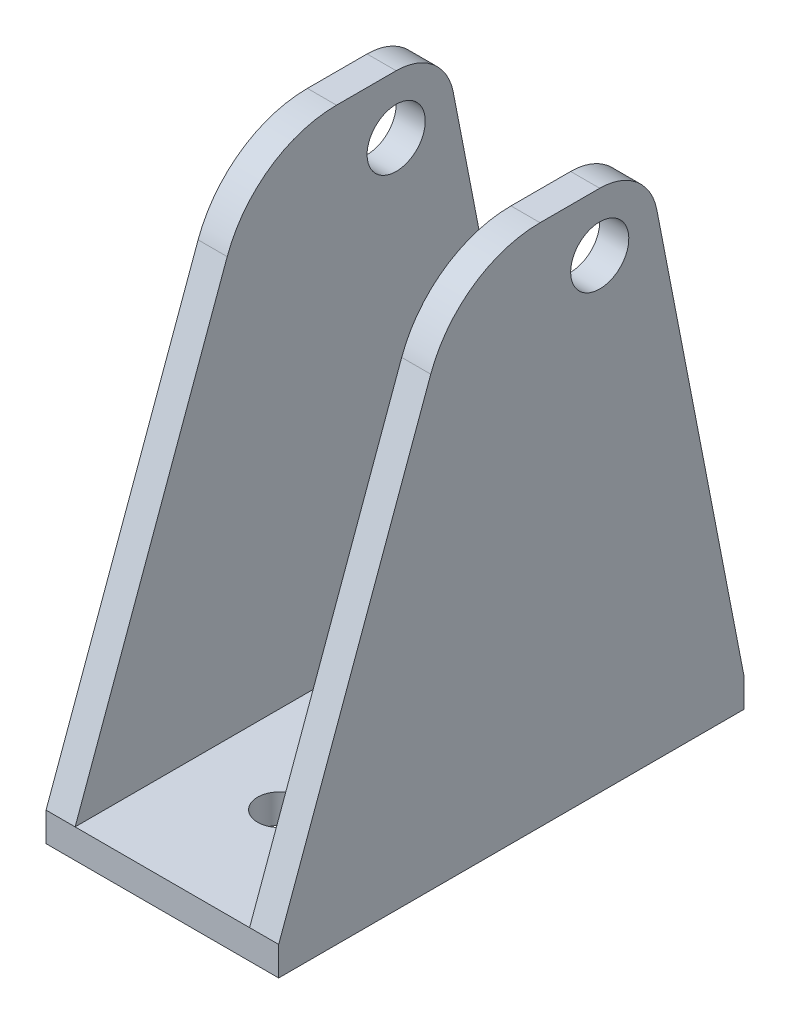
ISO-10303-21;
HEADER;
FILE_DESCRIPTION(('STEP AP214'),'2;1');
FILE_NAME('part.step','',(''),(''),'','','');
FILE_SCHEMA(('AUTOMOTIVE_DESIGN { 1 0 10303 214 1 1 1 1 }'));
ENDSEC;
DATA;
#1=APPLICATION_CONTEXT('core data for automotive mechanical design processes');
#2=APPLICATION_PROTOCOL_DEFINITION('international standard','automotive_design',2000,#1);
#3=PRODUCT_CONTEXT('',#1,'mechanical');
#4=PRODUCT('Part','Part','',(#3));
#5=PRODUCT_RELATED_PRODUCT_CATEGORY('part','',(#4));
#6=PRODUCT_DEFINITION_FORMATION('','',#4);
#7=PRODUCT_DEFINITION_CONTEXT('part definition',#1,'design');
#8=PRODUCT_DEFINITION('design','',#6,#7);
#9=PRODUCT_DEFINITION_SHAPE('','',#8);
#10=(LENGTH_UNIT() NAMED_UNIT(*) SI_UNIT(.MILLI.,.METRE.));
#11=(NAMED_UNIT(*) PLANE_ANGLE_UNIT() SI_UNIT($,.RADIAN.));
#12=(NAMED_UNIT(*) SI_UNIT($,.STERADIAN.) SOLID_ANGLE_UNIT());
#13=UNCERTAINTY_MEASURE_WITH_UNIT(LENGTH_MEASURE(1.E-05),#10,'distance_accuracy_value','');
#14=(GEOMETRIC_REPRESENTATION_CONTEXT(3) GLOBAL_UNCERTAINTY_ASSIGNED_CONTEXT((#13)) GLOBAL_UNIT_ASSIGNED_CONTEXT((#10,
#11,#12)) REPRESENTATION_CONTEXT('',''));
#15=CARTESIAN_POINT('',(0.,0.,0.));
#16=DIRECTION('',(0.,0.,1.));
#17=DIRECTION('',(1.,0.,0.));
#18=AXIS2_PLACEMENT_3D('',#15,#16,#17);
#19=CARTESIAN_POINT('',(25.401,-6.35,6.35));
#20=DIRECTION('',(-1.,0.,0.));
#21=DIRECTION('',(0.,0.,1.));
#22=AXIS2_PLACEMENT_3D('',#19,#20,#21);
#23=CYLINDRICAL_SURFACE('',#22,6.35);
#24=DIRECTION('',(1.,0.,0.));
#25=VECTOR('',#24,1.);
#26=CARTESIAN_POINT('',(-42.1329313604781,0.,6.35000000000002));
#27=LINE('',#26,#25);
#28=CARTESIAN_POINT('',(22.225,0.,6.35000000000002));
#29=VERTEX_POINT('',#28);
#30=CARTESIAN_POINT('',(25.3999999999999,0.,6.35));
#31=VERTEX_POINT('',#30);
#32=EDGE_CURVE('E264',#29,#31,#27,.T.);
#33=ORIENTED_EDGE('',*,*,#32,.T.);
#34=CARTESIAN_POINT('',(25.3999999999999,-6.35,6.35));
#35=DIRECTION('',(-1.,0.,0.));
#36=DIRECTION('',(0.,-1.,0.));
#37=AXIS2_PLACEMENT_3D('',#34,#35,#36);
#38=CIRCLE('',#37,6.35);
#39=CARTESIAN_POINT('',(25.4,-5.1356837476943,0.117188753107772));
#40=VERTEX_POINT('',#39);
#41=EDGE_CURVE('E184',#31,#40,#38,.T.);
#42=ORIENTED_EDGE('',*,*,#41,.T.);
#43=DIRECTION('',(-1.,0.,0.));
#44=VECTOR('',#43,1.);
#45=CARTESIAN_POINT('',(25.401,-5.1356837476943,0.117188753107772));
#46=LINE('',#45,#44);
#47=CARTESIAN_POINT('',(22.225,-5.1356837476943,0.117188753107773));
#48=VERTEX_POINT('',#47);
#49=EDGE_CURVE('E161',#40,#48,#46,.T.);
#50=ORIENTED_EDGE('',*,*,#49,.T.);
#51=CARTESIAN_POINT('',(22.225,-6.35,6.35));
#52=DIRECTION('',(1.,0.,0.));
#53=DIRECTION('',(0.,0.,1.));
#54=AXIS2_PLACEMENT_3D('',#51,#52,#53);
#55=CIRCLE('',#54,6.35);
#56=EDGE_CURVE('E172',#48,#29,#55,.T.);
#57=ORIENTED_EDGE('',*,*,#56,.T.);
#58=EDGE_LOOP('',(#33,#42,#50,#57));
#59=FACE_BOUND('',#58,.T.);
#60=ADVANCED_FACE('F51',(#59),#23,.T.);
#61=CARTESIAN_POINT('',(25.4,-53.975,38.1));
#62=DIRECTION('',(-1.,0.,0.));
#63=DIRECTION('',(0.,-1.,0.));
#64=AXIS2_PLACEMENT_3D('',#61,#62,#63);
#65=PLANE('',#64);
#66=CARTESIAN_POINT('',(25.3999999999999,-6.35,6.35));
#67=DIRECTION('',(-1.,0.,0.));
#68=DIRECTION('',(0.,-1.,0.));
#69=AXIS2_PLACEMENT_3D('',#66,#67,#68);
#70=CIRCLE('',#69,3.175);
#71=CARTESIAN_POINT('',(25.4,-9.525,6.35));
#72=VERTEX_POINT('',#71);
#73=EDGE_CURVE('E274',#72,#72,#70,.F.);
#74=ORIENTED_EDGE('',*,*,#73,.F.);
#75=EDGE_LOOP('',(#74));
#76=FACE_BOUND('',#75,.T.);
#77=DIRECTION('',(0.,0.,1.));
#78=VECTOR('',#77,1.);
#79=CARTESIAN_POINT('',(25.3999999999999,0.,6.35000000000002));
#80=LINE('',#79,#78);
#81=CARTESIAN_POINT('',(25.3999999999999,0.,12.8640708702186));
#82=VERTEX_POINT('',#81);
#83=EDGE_CURVE('E260',#31,#82,#80,.T.);
#84=ORIENTED_EDGE('',*,*,#83,.T.);
#85=CARTESIAN_POINT('',(25.4,-12.7,12.8640708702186));
#86=DIRECTION('',(-1.,0.,0.));
#87=DIRECTION('',(0.,-1.,0.));
#88=AXIS2_PLACEMENT_3D('',#85,#86,#87);
#89=CIRCLE('',#88,12.7);
#90=CARTESIAN_POINT('',(25.4,-8.35634417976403,24.7981671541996));
#91=VERTEX_POINT('',#90);
#92=EDGE_CURVE('E227',#82,#91,#89,.F.);
#93=ORIENTED_EDGE('',*,*,#92,.T.);
#94=DIRECTION('',(0.,-0.93969262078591,0.342020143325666));
#95=VECTOR('',#94,1.);
#96=CARTESIAN_POINT('',(25.4,-53.975,41.402));
#97=LINE('',#96,#95);
#98=CARTESIAN_POINT('',(25.4,-53.975,41.402));
#99=VERTEX_POINT('',#98);
#100=EDGE_CURVE('E267',#91,#99,#97,.T.);
#101=ORIENTED_EDGE('',*,*,#100,.T.);
#102=DIRECTION('',(0.,1.,0.));
#103=VECTOR('',#102,1.);
#104=CARTESIAN_POINT('',(25.4,-57.15,41.402));
#105=LINE('',#104,#103);
#106=CARTESIAN_POINT('',(25.4,-57.15,41.402));
#107=VERTEX_POINT('',#106);
#108=EDGE_CURVE('E302',#107,#99,#105,.T.);
#109=ORIENTED_EDGE('',*,*,#108,.F.);
#110=DIRECTION('',(0.,0.,-1.));
#111=VECTOR('',#110,1.);
#112=CARTESIAN_POINT('',(25.4,-57.15,38.1));
#113=LINE('',#112,#111);
#114=CARTESIAN_POINT('',(25.4,-57.15,-9.398));
#115=VERTEX_POINT('',#114);
#116=EDGE_CURVE('E219',#107,#115,#113,.T.);
#117=ORIENTED_EDGE('',*,*,#116,.T.);
#118=DIRECTION('',(0.,-1.,0.));
#119=VECTOR('',#118,1.);
#120=CARTESIAN_POINT('',(25.4,-53.975,-9.398));
#121=LINE('',#120,#119);
#122=CARTESIAN_POINT('',(25.4,-53.975,-9.398));
#123=VERTEX_POINT('',#122);
#124=EDGE_CURVE('E191',#123,#115,#121,.T.);
#125=ORIENTED_EDGE('',*,*,#124,.F.);
#126=DIRECTION('',(0.,-0.981545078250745,-0.191230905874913));
#127=VECTOR('',#126,1.);
#128=CARTESIAN_POINT('',(25.4,-53.975,-9.398));
#129=LINE('',#128,#127);
#130=EDGE_CURVE('E157',#40,#123,#129,.T.);
#131=ORIENTED_EDGE('',*,*,#130,.F.);
#132=ORIENTED_EDGE('',*,*,#41,.F.);
#133=EDGE_LOOP('',(#84,#93,#101,#109,#117,#125,#131,#132));
#134=FACE_BOUND('',#133,.T.);
#135=ADVANCED_FACE('F339',(#76,#134),#65,.F.);
#136=CARTESIAN_POINT('',(22.225,0.,-9.398));
#137=DIRECTION('',(1.,0.,0.));
#138=DIRECTION('',(0.,0.,-1.));
#139=AXIS2_PLACEMENT_3D('',#136,#137,#138);
#140=PLANE('',#139);
#141=DIRECTION('',(0.,0.93969262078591,-0.342020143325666));
#142=VECTOR('',#141,1.);
#143=CARTESIAN_POINT('',(22.225,-53.9750000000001,41.402));
#144=LINE('',#143,#142);
#145=CARTESIAN_POINT('',(22.225,-53.975,41.402));
#146=VERTEX_POINT('',#145);
#147=CARTESIAN_POINT('',(22.225,-8.35634417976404,24.7981671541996));
#148=VERTEX_POINT('',#147);
#149=EDGE_CURVE('E261',#146,#148,#144,.T.);
#150=ORIENTED_EDGE('',*,*,#149,.T.);
#151=CARTESIAN_POINT('',(22.225,-12.7,12.8640708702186));
#152=DIRECTION('',(1.,0.,0.));
#153=DIRECTION('',(0.,0.,-1.));
#154=AXIS2_PLACEMENT_3D('',#151,#152,#153);
#155=CIRCLE('',#154,12.7);
#156=CARTESIAN_POINT('',(22.225,0.,12.8640708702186));
#157=VERTEX_POINT('',#156);
#158=EDGE_CURVE('E231',#148,#157,#155,.F.);
#159=ORIENTED_EDGE('',*,*,#158,.T.);
#160=DIRECTION('',(0.,0.,-1.));
#161=VECTOR('',#160,1.);
#162=CARTESIAN_POINT('',(22.225,0.,6.35000000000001));
#163=LINE('',#162,#161);
#164=EDGE_CURVE('E263',#157,#29,#163,.T.);
#165=ORIENTED_EDGE('',*,*,#164,.T.);
#166=ORIENTED_EDGE('',*,*,#56,.F.);
#167=DIRECTION('',(0.,0.981545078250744,0.191230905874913));
#168=VECTOR('',#167,1.);
#169=CARTESIAN_POINT('',(22.225,-53.975,-9.398));
#170=LINE('',#169,#168);
#171=CARTESIAN_POINT('',(22.225,-53.975,-9.398));
#172=VERTEX_POINT('',#171);
#173=EDGE_CURVE('E155',#172,#48,#170,.T.);
#174=ORIENTED_EDGE('',*,*,#173,.F.);
#175=DIRECTION('',(0.,0.,1.));
#176=VECTOR('',#175,1.);
#177=CARTESIAN_POINT('',(22.225,-53.975,-9.398));
#178=LINE('',#177,#176);
#179=EDGE_CURVE('E169',#172,#146,#178,.T.);
#180=ORIENTED_EDGE('',*,*,#179,.T.);
#181=EDGE_LOOP('',(#150,#159,#165,#166,#174,#180));
#182=FACE_BOUND('',#181,.T.);
#183=CARTESIAN_POINT('',(22.225,-6.35,6.35));
#184=DIRECTION('',(-1.,0.,0.));
#185=DIRECTION('',(0.,0.,1.));
#186=AXIS2_PLACEMENT_3D('',#183,#184,#185);
#187=CIRCLE('',#186,3.175);
#188=CARTESIAN_POINT('',(22.225,-6.35,9.525));
#189=VERTEX_POINT('',#188);
#190=EDGE_CURVE('E271',#189,#189,#187,.T.);
#191=ORIENTED_EDGE('',*,*,#190,.F.);
#192=EDGE_LOOP('',(#191));
#193=FACE_BOUND('',#192,.T.);
#194=ADVANCED_FACE('F167',(#182,#193),#140,.F.);
#195=CARTESIAN_POINT('',(3.17500000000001,-53.975,38.1));
#196=DIRECTION('',(0.,-1.,0.));
#197=DIRECTION('',(0.,0.,-1.));
#198=AXIS2_PLACEMENT_3D('',#195,#196,#197);
#199=PLANE('',#198);
#200=CARTESIAN_POINT('',(12.7,-53.975,3.2246579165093));
#201=DIRECTION('',(0.,1.,0.));
#202=DIRECTION('',(0.,0.,1.));
#203=AXIS2_PLACEMENT_3D('',#200,#201,#202);
#204=CIRCLE('',#203,2.38125);
#205=CARTESIAN_POINT('',(12.7,-53.975,5.6059079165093));
#206=VERTEX_POINT('',#205);
#207=EDGE_CURVE('E205',#206,#206,#204,.T.);
#208=ORIENTED_EDGE('',*,*,#207,.F.);
#209=EDGE_LOOP('',(#208));
#210=FACE_BOUND('',#209,.T.);
#211=CARTESIAN_POINT('',(12.7,-53.975,28.6246579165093));
#212=DIRECTION('',(0.,1.,0.));
#213=DIRECTION('',(0.,0.,1.));
#214=AXIS2_PLACEMENT_3D('',#211,#212,#213);
#215=CIRCLE('',#214,2.38125);
#216=CARTESIAN_POINT('',(12.7,-53.975,31.0059079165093));
#217=VERTEX_POINT('',#216);
#218=EDGE_CURVE('E194',#217,#217,#215,.T.);
#219=ORIENTED_EDGE('',*,*,#218,.F.);
#220=EDGE_LOOP('',(#219));
#221=FACE_BOUND('',#220,.T.);
#222=ORIENTED_EDGE('',*,*,#179,.F.);
#223=DIRECTION('',(1.,0.,0.));
#224=VECTOR('',#223,1.);
#225=CARTESIAN_POINT('',(3.17500000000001,-53.975,-9.398));
#226=LINE('',#225,#224);
#227=CARTESIAN_POINT('',(3.17500000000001,-53.975,-9.398));
#228=VERTEX_POINT('',#227);
#229=EDGE_CURVE('E179',#228,#172,#226,.T.);
#230=ORIENTED_EDGE('',*,*,#229,.F.);
#231=DIRECTION('',(0.,0.,-1.));
#232=VECTOR('',#231,1.);
#233=CARTESIAN_POINT('',(3.17500000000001,-53.975,38.1));
#234=LINE('',#233,#232);
#235=CARTESIAN_POINT('',(3.17500000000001,-53.975,41.402));
#236=VERTEX_POINT('',#235);
#237=EDGE_CURVE('E217',#236,#228,#234,.T.);
#238=ORIENTED_EDGE('',*,*,#237,.F.);
#239=DIRECTION('',(-1.,0.,0.));
#240=VECTOR('',#239,1.);
#241=CARTESIAN_POINT('',(25.4,-53.975,41.402));
#242=LINE('',#241,#240);
#243=EDGE_CURVE('E181',#146,#236,#242,.T.);
#244=ORIENTED_EDGE('',*,*,#243,.F.);
#245=EDGE_LOOP('',(#222,#230,#238,#244));
#246=FACE_BOUND('',#245,.T.);
#247=ADVANCED_FACE('F177',(#210,#221,#246),#199,.F.);
#248=CARTESIAN_POINT('',(0.,0.,38.1));
#249=DIRECTION('',(1.,0.,0.));
#250=DIRECTION('',(0.,1.,0.));
#251=AXIS2_PLACEMENT_3D('',#248,#249,#250);
#252=PLANE('',#251);
#253=CARTESIAN_POINT('',(0.,-6.35,6.35));
#254=DIRECTION('',(1.,0.,0.));
#255=DIRECTION('',(0.,1.,0.));
#256=AXIS2_PLACEMENT_3D('',#253,#254,#255);
#257=CIRCLE('',#256,3.175);
#258=CARTESIAN_POINT('',(0.,-3.175,6.35));
#259=VERTEX_POINT('',#258);
#260=EDGE_CURVE('E214',#259,#259,#257,.F.);
#261=ORIENTED_EDGE('',*,*,#260,.F.);
#262=EDGE_LOOP('',(#261));
#263=FACE_BOUND('',#262,.T.);
#264=DIRECTION('',(0.,0.939692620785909,-0.342020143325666));
#265=VECTOR('',#264,1.);
#266=CARTESIAN_POINT('',(0.,-53.975,41.402));
#267=LINE('',#266,#265);
#268=CARTESIAN_POINT('',(0.,-53.975,41.402));
#269=VERTEX_POINT('',#268);
#270=CARTESIAN_POINT('',(0.,-8.35634417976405,24.7981671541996));
#271=VERTEX_POINT('',#270);
#272=EDGE_CURVE('E242',#269,#271,#267,.T.);
#273=ORIENTED_EDGE('',*,*,#272,.T.);
#274=CARTESIAN_POINT('',(0.,-12.7,12.8640708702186));
#275=DIRECTION('',(1.,0.,0.));
#276=DIRECTION('',(0.,1.,0.));
#277=AXIS2_PLACEMENT_3D('',#274,#275,#276);
#278=CIRCLE('',#277,12.7);
#279=CARTESIAN_POINT('',(0.,0.,12.8640708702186));
#280=VERTEX_POINT('',#279);
#281=EDGE_CURVE('E73',#271,#280,#278,.F.);
#282=ORIENTED_EDGE('',*,*,#281,.T.);
#283=DIRECTION('',(0.,0.,-1.));
#284=VECTOR('',#283,1.);
#285=CARTESIAN_POINT('',(0.,0.,21.7567066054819));
#286=LINE('',#285,#284);
#287=CARTESIAN_POINT('',(0.,0.,6.35));
#288=VERTEX_POINT('',#287);
#289=EDGE_CURVE('E250',#280,#288,#286,.T.);
#290=ORIENTED_EDGE('',*,*,#289,.T.);
#291=CARTESIAN_POINT('',(0.,-6.35,6.35));
#292=DIRECTION('',(1.,0.,0.));
#293=DIRECTION('',(0.,1.,0.));
#294=AXIS2_PLACEMENT_3D('',#291,#292,#293);
#295=CIRCLE('',#294,6.35);
#296=CARTESIAN_POINT('',(0.,-5.1356837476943,0.117188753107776));
#297=VERTEX_POINT('',#296);
#298=EDGE_CURVE('E291',#297,#288,#295,.T.);
#299=ORIENTED_EDGE('',*,*,#298,.F.);
#300=DIRECTION('',(0.,0.981545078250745,0.191230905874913));
#301=VECTOR('',#300,1.);
#302=CARTESIAN_POINT('',(0.,-5.1356837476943,0.117188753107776));
#303=LINE('',#302,#301);
#304=CARTESIAN_POINT('',(0.,-53.975,-9.398));
#305=VERTEX_POINT('',#304);
#306=EDGE_CURVE('E286',#305,#297,#303,.T.);
#307=ORIENTED_EDGE('',*,*,#306,.F.);
#308=DIRECTION('',(0.,1.,0.));
#309=VECTOR('',#308,1.);
#310=CARTESIAN_POINT('',(0.,-57.15,-9.398));
#311=LINE('',#310,#309);
#312=CARTESIAN_POINT('',(0.,-57.15,-9.398));
#313=VERTEX_POINT('',#312);
#314=EDGE_CURVE('E192',#313,#305,#311,.T.);
#315=ORIENTED_EDGE('',*,*,#314,.F.);
#316=DIRECTION('',(0.,0.,-1.));
#317=VECTOR('',#316,1.);
#318=CARTESIAN_POINT('',(0.,-57.15,38.1));
#319=LINE('',#318,#317);
#320=CARTESIAN_POINT('',(0.,-57.15,41.402));
#321=VERTEX_POINT('',#320);
#322=EDGE_CURVE('E222',#321,#313,#319,.T.);
#323=ORIENTED_EDGE('',*,*,#322,.F.);
#324=DIRECTION('',(0.,-1.,0.));
#325=VECTOR('',#324,1.);
#326=CARTESIAN_POINT('',(0.,0.,41.402));
#327=LINE('',#326,#325);
#328=EDGE_CURVE('E249',#269,#321,#327,.T.);
#329=ORIENTED_EDGE('',*,*,#328,.F.);
#330=EDGE_LOOP('',(#273,#282,#290,#299,#307,#315,#323,#329));
#331=FACE_BOUND('',#330,.T.);
#332=ADVANCED_FACE('F247',(#263,#331),#252,.F.);
#333=CARTESIAN_POINT('',(0.,-57.15,38.1));
#334=DIRECTION('',(0.,1.,0.));
#335=DIRECTION('',(0.,0.,1.));
#336=AXIS2_PLACEMENT_3D('',#333,#334,#335);
#337=PLANE('',#336);
#338=CARTESIAN_POINT('',(12.7,-57.15,28.6246579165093));
#339=DIRECTION('',(0.,1.,0.));
#340=DIRECTION('',(0.,0.,1.));
#341=AXIS2_PLACEMENT_3D('',#338,#339,#340);
#342=CIRCLE('',#341,2.38125);
#343=CARTESIAN_POINT('',(12.7,-57.15,31.0059079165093));
#344=VERTEX_POINT('',#343);
#345=EDGE_CURVE('E202',#344,#344,#342,.F.);
#346=ORIENTED_EDGE('',*,*,#345,.F.);
#347=EDGE_LOOP('',(#346));
#348=FACE_BOUND('',#347,.T.);
#349=CARTESIAN_POINT('',(12.7,-57.15,3.2246579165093));
#350=DIRECTION('',(0.,1.,0.));
#351=DIRECTION('',(0.,0.,1.));
#352=AXIS2_PLACEMENT_3D('',#349,#350,#351);
#353=CIRCLE('',#352,2.38125);
#354=CARTESIAN_POINT('',(12.7,-57.15,5.6059079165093));
#355=VERTEX_POINT('',#354);
#356=EDGE_CURVE('E208',#355,#355,#353,.F.);
#357=ORIENTED_EDGE('',*,*,#356,.F.);
#358=EDGE_LOOP('',(#357));
#359=FACE_BOUND('',#358,.T.);
#360=ORIENTED_EDGE('',*,*,#322,.T.);
#361=DIRECTION('',(-1.,0.,0.));
#362=VECTOR('',#361,1.);
#363=CARTESIAN_POINT('',(25.4,-57.15,-9.398));
#364=LINE('',#363,#362);
#365=EDGE_CURVE('E196',#115,#313,#364,.T.);
#366=ORIENTED_EDGE('',*,*,#365,.F.);
#367=ORIENTED_EDGE('',*,*,#116,.F.);
#368=DIRECTION('',(1.,0.,0.));
#369=VECTOR('',#368,1.);
#370=CARTESIAN_POINT('',(0.,-57.15,41.402));
#371=LINE('',#370,#369);
#372=EDGE_CURVE('E299',#321,#107,#371,.T.);
#373=ORIENTED_EDGE('',*,*,#372,.F.);
#374=EDGE_LOOP('',(#360,#366,#367,#373));
#375=FACE_BOUND('',#374,.T.);
#376=ADVANCED_FACE('F309',(#348,#359,#375),#337,.F.);
#377=CARTESIAN_POINT('',(3.175,0.,38.1));
#378=DIRECTION('',(-1.,0.,0.));
#379=DIRECTION('',(0.,-1.,0.));
#380=AXIS2_PLACEMENT_3D('',#377,#378,#379);
#381=PLANE('',#380);
#382=DIRECTION('',(0.,0.,1.));
#383=VECTOR('',#382,1.);
#384=CARTESIAN_POINT('',(3.175,0.,21.7567066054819));
#385=LINE('',#384,#383);
#386=CARTESIAN_POINT('',(3.175,0.,6.35000000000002));
#387=VERTEX_POINT('',#386);
#388=CARTESIAN_POINT('',(3.175,0.,12.8640708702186));
#389=VERTEX_POINT('',#388);
#390=EDGE_CURVE('E255',#387,#389,#385,.T.);
#391=ORIENTED_EDGE('',*,*,#390,.T.);
#392=CARTESIAN_POINT('',(3.175,-12.7,12.8640708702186));
#393=DIRECTION('',(-1.,0.,0.));
#394=DIRECTION('',(0.,-1.,0.));
#395=AXIS2_PLACEMENT_3D('',#392,#393,#394);
#396=CIRCLE('',#395,12.7);
#397=CARTESIAN_POINT('',(3.17499999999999,-8.35634417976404,24.7981671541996));
#398=VERTEX_POINT('',#397);
#399=EDGE_CURVE('E13',#389,#398,#396,.F.);
#400=ORIENTED_EDGE('',*,*,#399,.T.);
#401=DIRECTION('',(0.,-0.93969262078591,0.342020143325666));
#402=VECTOR('',#401,1.);
#403=CARTESIAN_POINT('',(3.175,-53.975,41.402));
#404=LINE('',#403,#402);
#405=EDGE_CURVE('E243',#398,#236,#404,.T.);
#406=ORIENTED_EDGE('',*,*,#405,.T.);
#407=ORIENTED_EDGE('',*,*,#237,.T.);
#408=DIRECTION('',(0.,-0.981545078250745,-0.191230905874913));
#409=VECTOR('',#408,1.);
#410=CARTESIAN_POINT('',(3.175,-5.1356837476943,0.117188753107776));
#411=LINE('',#410,#409);
#412=CARTESIAN_POINT('',(3.175,-5.1356837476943,0.117188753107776));
#413=VERTEX_POINT('',#412);
#414=EDGE_CURVE('E183',#413,#228,#411,.T.);
#415=ORIENTED_EDGE('',*,*,#414,.F.);
#416=CARTESIAN_POINT('',(3.175,-6.35,6.35));
#417=DIRECTION('',(-1.,0.,0.));
#418=DIRECTION('',(0.,1.,0.));
#419=AXIS2_PLACEMENT_3D('',#416,#417,#418);
#420=CIRCLE('',#419,6.35);
#421=EDGE_CURVE('E294',#387,#413,#420,.T.);
#422=ORIENTED_EDGE('',*,*,#421,.F.);
#423=EDGE_LOOP('',(#391,#400,#406,#407,#415,#422));
#424=FACE_BOUND('',#423,.T.);
#425=CARTESIAN_POINT('',(3.175,-6.35,6.35));
#426=DIRECTION('',(1.,0.,0.));
#427=DIRECTION('',(0.,1.,0.));
#428=AXIS2_PLACEMENT_3D('',#425,#426,#427);
#429=CIRCLE('',#428,3.175);
#430=CARTESIAN_POINT('',(3.175,-3.175,6.35));
#431=VERTEX_POINT('',#430);
#432=EDGE_CURVE('E211',#431,#431,#429,.T.);
#433=ORIENTED_EDGE('',*,*,#432,.F.);
#434=EDGE_LOOP('',(#433));
#435=FACE_BOUND('',#434,.T.);
#436=ADVANCED_FACE('F318',(#424,#435),#381,.F.);
#437=CARTESIAN_POINT('',(-0.00100000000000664,-6.35,6.35));
#438=DIRECTION('',(1.,0.,0.));
#439=DIRECTION('',(0.,1.,0.));
#440=AXIS2_PLACEMENT_3D('',#437,#438,#439);
#441=CYLINDRICAL_SURFACE('',#440,3.175);
#442=ORIENTED_EDGE('',*,*,#432,.T.);
#443=EDGE_LOOP('',(#442));
#444=FACE_BOUND('',#443,.T.);
#445=ORIENTED_EDGE('',*,*,#260,.T.);
#446=EDGE_LOOP('',(#445));
#447=FACE_BOUND('',#446,.T.);
#448=ADVANCED_FACE('F372',(#444,#447),#441,.F.);
#449=CARTESIAN_POINT('',(12.7,-57.151,3.2246579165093));
#450=DIRECTION('',(0.,1.,0.));
#451=DIRECTION('',(0.,0.,1.));
#452=AXIS2_PLACEMENT_3D('',#449,#450,#451);
#453=CYLINDRICAL_SURFACE('',#452,2.38125);
#454=ORIENTED_EDGE('',*,*,#207,.T.);
#455=EDGE_LOOP('',(#454));
#456=FACE_BOUND('',#455,.T.);
#457=ORIENTED_EDGE('',*,*,#356,.T.);
#458=EDGE_LOOP('',(#457));
#459=FACE_BOUND('',#458,.T.);
#460=ADVANCED_FACE('F368',(#456,#459),#453,.F.);
#461=CARTESIAN_POINT('',(12.7,-57.151,28.6246579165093));
#462=DIRECTION('',(0.,1.,0.));
#463=DIRECTION('',(0.,0.,1.));
#464=AXIS2_PLACEMENT_3D('',#461,#462,#463);
#465=CYLINDRICAL_SURFACE('',#464,2.38125);
#466=ORIENTED_EDGE('',*,*,#218,.T.);
#467=EDGE_LOOP('',(#466));
#468=FACE_BOUND('',#467,.T.);
#469=ORIENTED_EDGE('',*,*,#345,.T.);
#470=EDGE_LOOP('',(#469));
#471=FACE_BOUND('',#470,.T.);
#472=ADVANCED_FACE('F365',(#468,#471),#465,.F.);
#473=CARTESIAN_POINT('',(0.,0.,-9.398));
#474=DIRECTION('',(0.,0.,-1.));
#475=DIRECTION('',(-1.,0.,0.));
#476=AXIS2_PLACEMENT_3D('',#473,#474,#475);
#477=PLANE('',#476);
#478=DIRECTION('',(-1.,0.,0.));
#479=VECTOR('',#478,1.);
#480=CARTESIAN_POINT('',(25.401,-53.975,-9.398));
#481=LINE('',#480,#479);
#482=EDGE_CURVE('E151',#123,#172,#481,.T.);
#483=ORIENTED_EDGE('',*,*,#482,.F.);
#484=ORIENTED_EDGE('',*,*,#124,.T.);
#485=ORIENTED_EDGE('',*,*,#365,.T.);
#486=ORIENTED_EDGE('',*,*,#314,.T.);
#487=DIRECTION('',(1.,0.,0.));
#488=VECTOR('',#487,1.);
#489=CARTESIAN_POINT('',(-0.00100000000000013,-53.975,-9.398));
#490=LINE('',#489,#488);
#491=EDGE_CURVE('E189',#305,#228,#490,.T.);
#492=ORIENTED_EDGE('',*,*,#491,.T.);
#493=ORIENTED_EDGE('',*,*,#229,.T.);
#494=EDGE_LOOP('',(#483,#484,#485,#486,#492,#493));
#495=FACE_BOUND('',#494,.T.);
#496=ADVANCED_FACE('F187',(#495),#477,.T.);
#497=CARTESIAN_POINT('',(0.,0.,41.402));
#498=DIRECTION('',(0.,0.,1.));
#499=DIRECTION('',(1.,0.,0.));
#500=AXIS2_PLACEMENT_3D('',#497,#498,#499);
#501=PLANE('',#500);
#502=DIRECTION('',(-1.,0.,0.));
#503=VECTOR('',#502,1.);
#504=CARTESIAN_POINT('',(25.401,-53.975,41.402));
#505=LINE('',#504,#503);
#506=EDGE_CURVE('E280',#99,#146,#505,.T.);
#507=ORIENTED_EDGE('',*,*,#506,.T.);
#508=ORIENTED_EDGE('',*,*,#243,.T.);
#509=DIRECTION('',(1.,0.,0.));
#510=VECTOR('',#509,1.);
#511=CARTESIAN_POINT('',(-0.00100000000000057,-53.975,41.402));
#512=LINE('',#511,#510);
#513=EDGE_CURVE('E296',#269,#236,#512,.T.);
#514=ORIENTED_EDGE('',*,*,#513,.F.);
#515=ORIENTED_EDGE('',*,*,#328,.T.);
#516=ORIENTED_EDGE('',*,*,#372,.T.);
#517=ORIENTED_EDGE('',*,*,#108,.T.);
#518=EDGE_LOOP('',(#507,#508,#514,#515,#516,#517));
#519=FACE_BOUND('',#518,.T.);
#520=ADVANCED_FACE('F321',(#519),#501,.T.);
#521=CARTESIAN_POINT('',(-0.0010000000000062,-6.35,6.35));
#522=DIRECTION('',(1.,0.,0.));
#523=DIRECTION('',(0.,1.,0.));
#524=AXIS2_PLACEMENT_3D('',#521,#522,#523);
#525=CYLINDRICAL_SURFACE('',#524,6.35);
#526=ORIENTED_EDGE('',*,*,#298,.T.);
#527=DIRECTION('',(-1.,0.,0.));
#528=VECTOR('',#527,1.);
#529=CARTESIAN_POINT('',(67.532931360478,0.,6.35000000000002));
#530=LINE('',#529,#528);
#531=EDGE_CURVE('E252',#387,#288,#530,.T.);
#532=ORIENTED_EDGE('',*,*,#531,.F.);
#533=ORIENTED_EDGE('',*,*,#421,.T.);
#534=DIRECTION('',(1.,0.,0.));
#535=VECTOR('',#534,1.);
#536=CARTESIAN_POINT('',(-0.0010000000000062,-5.1356837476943,0.117188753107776));
#537=LINE('',#536,#535);
#538=EDGE_CURVE('E284',#297,#413,#537,.T.);
#539=ORIENTED_EDGE('',*,*,#538,.F.);
#540=EDGE_LOOP('',(#526,#532,#533,#539));
#541=FACE_BOUND('',#540,.T.);
#542=ADVANCED_FACE('F357',(#541),#525,.T.);
#543=CARTESIAN_POINT('',(-0.0010000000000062,-5.1356837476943,0.117188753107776));
#544=DIRECTION('',(0.,-0.191230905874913,0.981545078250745));
#545=DIRECTION('',(0.,-0.981545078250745,-0.191230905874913));
#546=AXIS2_PLACEMENT_3D('',#543,#544,#545);
#547=PLANE('',#546);
#548=ORIENTED_EDGE('',*,*,#306,.T.);
#549=ORIENTED_EDGE('',*,*,#538,.T.);
#550=ORIENTED_EDGE('',*,*,#414,.T.);
#551=ORIENTED_EDGE('',*,*,#491,.F.);
#552=EDGE_LOOP('',(#548,#549,#550,#551));
#553=FACE_BOUND('',#552,.T.);
#554=ADVANCED_FACE('F314',(#553),#547,.F.);
#555=CARTESIAN_POINT('',(25.401,-53.975,-9.398));
#556=DIRECTION('',(0.,-0.191230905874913,0.981545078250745));
#557=DIRECTION('',(0.,-0.981545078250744,-0.191230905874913));
#558=AXIS2_PLACEMENT_3D('',#555,#556,#557);
#559=PLANE('',#558);
#560=ORIENTED_EDGE('',*,*,#130,.T.);
#561=ORIENTED_EDGE('',*,*,#482,.T.);
#562=ORIENTED_EDGE('',*,*,#173,.T.);
#563=ORIENTED_EDGE('',*,*,#49,.F.);
#564=EDGE_LOOP('',(#560,#561,#562,#563));
#565=FACE_BOUND('',#564,.T.);
#566=ADVANCED_FACE('F153',(#565),#559,.F.);
#567=CARTESIAN_POINT('',(25.401,-6.35,6.35));
#568=DIRECTION('',(-1.,0.,0.));
#569=DIRECTION('',(0.,0.,1.));
#570=AXIS2_PLACEMENT_3D('',#567,#568,#569);
#571=CYLINDRICAL_SURFACE('',#570,3.175);
#572=ORIENTED_EDGE('',*,*,#190,.T.);
#573=EDGE_LOOP('',(#572));
#574=FACE_BOUND('',#573,.T.);
#575=ORIENTED_EDGE('',*,*,#73,.T.);
#576=EDGE_LOOP('',(#575));
#577=FACE_BOUND('',#576,.T.);
#578=ADVANCED_FACE('F400',(#574,#577),#571,.F.);
#579=CARTESIAN_POINT('',(-42.132931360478,-53.9750000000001,41.402));
#580=DIRECTION('',(0.,0.342020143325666,0.93969262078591));
#581=DIRECTION('',(0.,-0.93969262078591,0.342020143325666));
#582=AXIS2_PLACEMENT_3D('',#579,#580,#581);
#583=PLANE('',#582);
#584=ORIENTED_EDGE('',*,*,#100,.F.);
#585=DIRECTION('',(1.,0.,0.));
#586=VECTOR('',#585,1.);
#587=CARTESIAN_POINT('',(-42.132931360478,-8.35634417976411,24.7981671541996));
#588=LINE('',#587,#586);
#589=EDGE_CURVE('E229',#91,#148,#588,.F.);
#590=ORIENTED_EDGE('',*,*,#589,.T.);
#591=ORIENTED_EDGE('',*,*,#149,.F.);
#592=ORIENTED_EDGE('',*,*,#506,.F.);
#593=EDGE_LOOP('',(#584,#590,#591,#592));
#594=FACE_BOUND('',#593,.T.);
#595=ADVANCED_FACE('F326',(#594),#583,.T.);
#596=CARTESIAN_POINT('',(-42.1329313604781,0.,6.35000000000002));
#597=DIRECTION('',(0.,1.,0.));
#598=DIRECTION('',(0.,0.,1.));
#599=AXIS2_PLACEMENT_3D('',#596,#597,#598);
#600=PLANE('',#599);
#601=ORIENTED_EDGE('',*,*,#164,.F.);
#602=DIRECTION('',(1.,0.,0.));
#603=VECTOR('',#602,1.);
#604=CARTESIAN_POINT('',(-42.1329313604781,0.,12.8640708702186));
#605=LINE('',#604,#603);
#606=EDGE_CURVE('E224',#157,#82,#605,.T.);
#607=ORIENTED_EDGE('',*,*,#606,.T.);
#608=ORIENTED_EDGE('',*,*,#83,.F.);
#609=ORIENTED_EDGE('',*,*,#32,.F.);
#610=EDGE_LOOP('',(#601,#607,#608,#609));
#611=FACE_BOUND('',#610,.T.);
#612=ADVANCED_FACE('F335',(#611),#600,.T.);
#613=CARTESIAN_POINT('',(67.532931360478,0.,21.7567066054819));
#614=DIRECTION('',(0.,1.,0.));
#615=DIRECTION('',(-1.,0.,0.));
#616=AXIS2_PLACEMENT_3D('',#613,#614,#615);
#617=PLANE('',#616);
#618=ORIENTED_EDGE('',*,*,#289,.F.);
#619=DIRECTION('',(-1.,0.,0.));
#620=VECTOR('',#619,1.);
#621=CARTESIAN_POINT('',(67.532931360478,0.,12.8640708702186));
#622=LINE('',#621,#620);
#623=EDGE_CURVE('E59',#280,#389,#622,.F.);
#624=ORIENTED_EDGE('',*,*,#623,.T.);
#625=ORIENTED_EDGE('',*,*,#390,.F.);
#626=ORIENTED_EDGE('',*,*,#531,.T.);
#627=EDGE_LOOP('',(#618,#624,#625,#626));
#628=FACE_BOUND('',#627,.T.);
#629=ADVANCED_FACE('F391',(#628),#617,.T.);
#630=CARTESIAN_POINT('',(67.532931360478,-53.975,41.402));
#631=DIRECTION('',(0.,0.342020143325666,0.93969262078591));
#632=DIRECTION('',(0.,-0.939692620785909,0.342020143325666));
#633=AXIS2_PLACEMENT_3D('',#630,#631,#632);
#634=PLANE('',#633);
#635=ORIENTED_EDGE('',*,*,#405,.F.);
#636=DIRECTION('',(-1.,0.,0.));
#637=VECTOR('',#636,1.);
#638=CARTESIAN_POINT('',(67.532931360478,-8.35634417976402,24.7981671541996));
#639=LINE('',#638,#637);
#640=EDGE_CURVE('E233',#398,#271,#639,.T.);
#641=ORIENTED_EDGE('',*,*,#640,.T.);
#642=ORIENTED_EDGE('',*,*,#272,.F.);
#643=ORIENTED_EDGE('',*,*,#513,.T.);
#644=EDGE_LOOP('',(#635,#641,#642,#643));
#645=FACE_BOUND('',#644,.T.);
#646=ADVANCED_FACE('F240',(#645),#634,.T.);
#647=CARTESIAN_POINT('',(-42.132931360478,-12.7000000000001,12.8640708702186));
#648=DIRECTION('',(1.,0.,0.));
#649=DIRECTION('',(0.,1.,0.));
#650=AXIS2_PLACEMENT_3D('',#647,#648,#649);
#651=CYLINDRICAL_SURFACE('',#650,12.7);
#652=ORIENTED_EDGE('',*,*,#158,.F.);
#653=ORIENTED_EDGE('',*,*,#589,.F.);
#654=ORIENTED_EDGE('',*,*,#92,.F.);
#655=ORIENTED_EDGE('',*,*,#606,.F.);
#656=EDGE_LOOP('',(#652,#653,#654,#655));
#657=FACE_BOUND('',#656,.T.);
#658=ADVANCED_FACE('F332',(#657),#651,.T.);
#659=CARTESIAN_POINT('',(67.532931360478,-12.7,12.8640708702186));
#660=DIRECTION('',(-1.,0.,0.));
#661=DIRECTION('',(0.,-1.,0.));
#662=AXIS2_PLACEMENT_3D('',#659,#660,#661);
#663=CYLINDRICAL_SURFACE('',#662,12.7);
#664=ORIENTED_EDGE('',*,*,#399,.F.);
#665=ORIENTED_EDGE('',*,*,#623,.F.);
#666=ORIENTED_EDGE('',*,*,#281,.F.);
#667=ORIENTED_EDGE('',*,*,#640,.F.);
#668=EDGE_LOOP('',(#664,#665,#666,#667));
#669=FACE_BOUND('',#668,.T.);
#670=ADVANCED_FACE('F53',(#669),#663,.T.);
#671=CLOSED_SHELL('',(#60,#135,#194,#247,#332,#376,#436,#448,#460,#472,#496,#520,#542,#554,#566,
#578,#595,#612,#629,#646,#658,#670));
#672=MANIFOLD_SOLID_BREP('B2',#671);
#673=ADVANCED_BREP_SHAPE_REPRESENTATION('',(#18,#672),#14);
#674=SHAPE_DEFINITION_REPRESENTATION(#9,#673);
ENDSEC;
END-ISO-10303-21;
